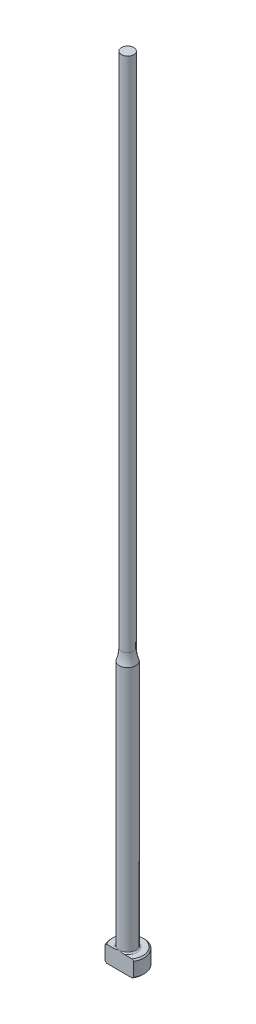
from build123d import *

# Parameters (mm, degrees)
CHAMFER1_SIZE      = 0.254
FILLET1_R          = 0.254
CUT_EXTRUDE1_DEPTH = 153.466131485


with BuildPart() as part:
    # Sketch1 → Revolve1 (revolve)
    with BuildSketch(Plane.XY, mode=Mode.PRIVATE) as revolve1_sk:
        with BuildLine():
            Line((0, 0), (-3.175, 0))
            Line((-3.175, 0), (-3.175, 3.175))
            Line((-3.175, 3.175), (-1.5875, 3.175))
            Line((-1.5875, 3.175), (-1.5875, 50.8))
            ThreePointArc((-1.5875, 50.8), (-1.290157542, 51.887986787), (-1.18999, 53.011416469))
            Line((-1.18999, 53.011416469), (-1.18999, 152.4))
            Line((-1.18999, 152.4), (0, 152.4))
            Line((0, 152.4), (0, 0))
        make_face()
    revolve(revolve1_sk.sketch.rotate(Axis((0, 259.958771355, 0), (0, -1, 0)), 270), axis=Axis((0, 259.958771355, 0), (0, -1, 0)))

    # Chamfer1
    chamfer1_edges = [part.edges().sort_by_distance(p)[0] for p in [
        (0, 0, -3.175),
        (0, 3.175, -3.175),
    ]]
    chamfer(chamfer1_edges, length=CHAMFER1_SIZE)

    # Fillet1
    fillet1_edges = [part.edges().sort_by_distance(p)[0] for p in [
        (0, 3.175, -1.5875),
    ]]
    fillet(fillet1_edges, radius=FILLET1_R)

    # Sketch2 → Cut-Extrude1 (cut, through all)
    with BuildSketch(Plane.XZ):
        with BuildLine():
            Line((-2.749630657, 1.5875), (2.749630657, 1.5875))
            ThreePointArc((2.749630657, 1.5875), (0, 3.175), (-2.749630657, 1.5875))
        make_face()
    extrude(amount=-CUT_EXTRUDE1_DEPTH, mode=Mode.SUBTRACT)


solid = part.part
